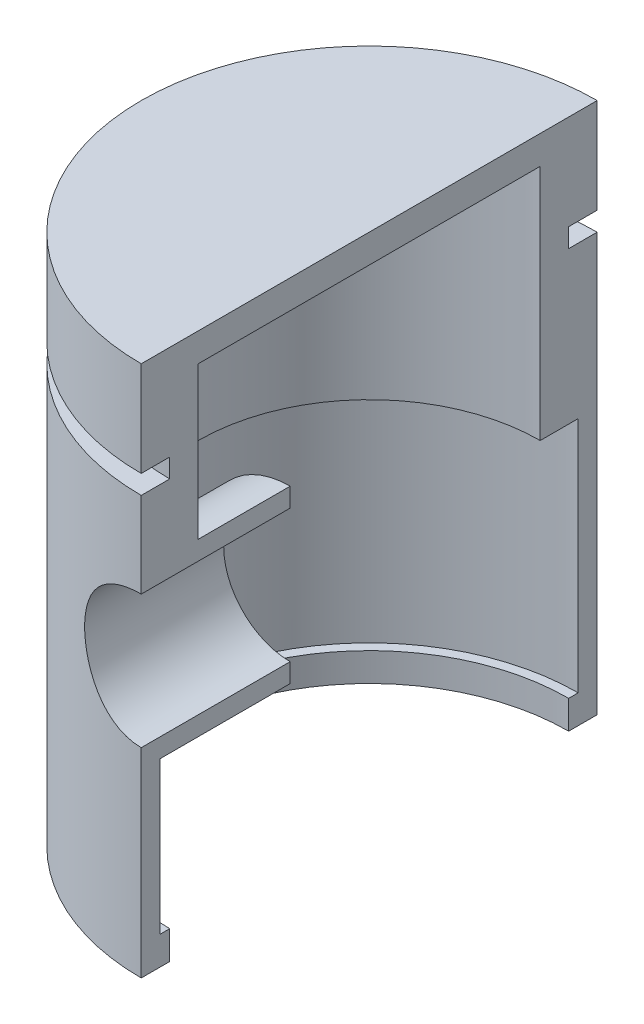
ISO-10303-21;
HEADER;
FILE_DESCRIPTION(('STEP AP214'),'2;1');
FILE_NAME('part.step','',(''),(''),'','','');
FILE_SCHEMA(('AUTOMOTIVE_DESIGN { 1 0 10303 214 1 1 1 1 }'));
ENDSEC;
DATA;
#1=APPLICATION_CONTEXT('core data for automotive mechanical design processes');
#2=APPLICATION_PROTOCOL_DEFINITION('international standard','automotive_design',2000,#1);
#3=PRODUCT_CONTEXT('',#1,'mechanical');
#4=PRODUCT('Part','Part','',(#3));
#5=PRODUCT_RELATED_PRODUCT_CATEGORY('part','',(#4));
#6=PRODUCT_DEFINITION_FORMATION('','',#4);
#7=PRODUCT_DEFINITION_CONTEXT('part definition',#1,'design');
#8=PRODUCT_DEFINITION('design','',#6,#7);
#9=PRODUCT_DEFINITION_SHAPE('','',#8);
#10=(LENGTH_UNIT() NAMED_UNIT(*) SI_UNIT(.MILLI.,.METRE.));
#11=(NAMED_UNIT(*) PLANE_ANGLE_UNIT() SI_UNIT($,.RADIAN.));
#12=(NAMED_UNIT(*) SI_UNIT($,.STERADIAN.) SOLID_ANGLE_UNIT());
#13=UNCERTAINTY_MEASURE_WITH_UNIT(LENGTH_MEASURE(1.E-05),#10,'distance_accuracy_value','');
#14=(GEOMETRIC_REPRESENTATION_CONTEXT(3) GLOBAL_UNCERTAINTY_ASSIGNED_CONTEXT((#13)) GLOBAL_UNIT_ASSIGNED_CONTEXT((#10,
#11,#12)) REPRESENTATION_CONTEXT('',''));
#15=CARTESIAN_POINT('',(0.,0.,0.));
#16=DIRECTION('',(0.,0.,1.));
#17=DIRECTION('',(1.,0.,0.));
#18=AXIS2_PLACEMENT_3D('',#15,#16,#17);
#19=CARTESIAN_POINT('',(0.,88.9,0.));
#20=DIRECTION('',(0.,-1.,0.));
#21=DIRECTION('',(0.,0.,-1.));
#22=AXIS2_PLACEMENT_3D('',#19,#20,#21);
#23=CYLINDRICAL_SURFACE('',#22,38.1);
#24=DIRECTION('',(0.,1.,0.));
#25=VECTOR('',#24,1.);
#26=CARTESIAN_POINT('',(2.66050878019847E-13,0.,38.1));
#27=LINE('',#26,#25);
#28=CARTESIAN_POINT('',(2.66050878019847E-13,55.5625,38.1));
#29=VERTEX_POINT('',#28);
#30=CARTESIAN_POINT('',(-1.13939569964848E-10,69.85,38.1));
#31=VERTEX_POINT('',#30);
#32=EDGE_CURVE('E193',#29,#31,#27,.T.);
#33=ORIENTED_EDGE('',*,*,#32,.T.);
#34=CARTESIAN_POINT('',(-1.13939569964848E-10,69.85,0.));
#35=DIRECTION('',(0.,1.,0.));
#36=DIRECTION('',(0.,0.,1.));
#37=AXIS2_PLACEMENT_3D('',#34,#35,#36);
#38=CIRCLE('',#37,38.1);
#39=CARTESIAN_POINT('',(-2.66050878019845E-13,69.85,-38.1));
#40=VERTEX_POINT('',#39);
#41=EDGE_CURVE('E238',#40,#31,#38,.T.);
#42=ORIENTED_EDGE('',*,*,#41,.F.);
#43=DIRECTION('',(0.,1.,0.));
#44=VECTOR('',#43,1.);
#45=CARTESIAN_POINT('',(0.,0.,-38.1));
#46=LINE('',#45,#44);
#47=CARTESIAN_POINT('',(0.,0.,-38.1));
#48=VERTEX_POINT('',#47);
#49=EDGE_CURVE('E161',#48,#40,#46,.T.);
#50=ORIENTED_EDGE('',*,*,#49,.F.);
#51=CARTESIAN_POINT('',(0.,0.,0.));
#52=DIRECTION('',(0.,-1.,0.));
#53=DIRECTION('',(0.,0.,-1.));
#54=AXIS2_PLACEMENT_3D('',#51,#52,#53);
#55=CIRCLE('',#54,38.1);
#56=CARTESIAN_POINT('',(2.66050878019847E-13,0.,38.1));
#57=VERTEX_POINT('',#56);
#58=EDGE_CURVE('E228',#57,#48,#55,.T.);
#59=ORIENTED_EDGE('',*,*,#58,.F.);
#60=CARTESIAN_POINT('',(2.66050878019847E-13,33.3375,38.1));
#61=VERTEX_POINT('',#60);
#62=EDGE_CURVE('E189',#57,#61,#27,.T.);
#63=ORIENTED_EDGE('',*,*,#62,.T.);
#64=CARTESIAN_POINT('',(2.58462887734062E-13,33.3375,38.1));
#65=CARTESIAN_POINT('',(-0.305678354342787,33.3374597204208,38.100035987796));
#66=CARTESIAN_POINT('',(-0.611343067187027,33.3501109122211,38.0963225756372));
#67=CARTESIAN_POINT('',(-1.22036643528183,33.4004993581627,38.0816587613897));
#68=CARTESIAN_POINT('',(-1.52372551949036,33.4382318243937,38.0707097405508));
#69=CARTESIAN_POINT('',(-2.12528794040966,33.5383714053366,38.0418693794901));
#70=CARTESIAN_POINT('',(-2.42350148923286,33.6007218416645,38.0239939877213));
#71=CARTESIAN_POINT('',(-3.01338059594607,33.7495464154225,37.9817973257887));
#72=CARTESIAN_POINT('',(-3.30504603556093,33.8360209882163,37.9574759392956));
#73=CARTESIAN_POINT('',(-3.87970046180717,34.0323351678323,37.903050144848));
#74=CARTESIAN_POINT('',(-4.16269313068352,34.1421646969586,37.8729482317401));
#75=CARTESIAN_POINT('',(-4.71837293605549,34.3843895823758,37.8077406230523));
#76=CARTESIAN_POINT('',(-4.99105614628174,34.5167934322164,37.7726330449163));
#77=CARTESIAN_POINT('',(-5.52425014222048,34.803141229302,37.6983437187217));
#78=CARTESIAN_POINT('',(-5.78476196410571,34.9570833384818,37.6591623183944));
#79=CARTESIAN_POINT('',(-6.2921527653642,35.285511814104,37.5777178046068));
#80=CARTESIAN_POINT('',(-6.53902542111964,35.4600075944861,37.5354532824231));
#81=CARTESIAN_POINT('',(-7.02337262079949,35.8328336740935,37.4478875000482));
#82=CARTESIAN_POINT('',(-7.26047055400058,36.0316418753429,37.4025372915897));
#83=CARTESIAN_POINT('',(-7.71708594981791,36.4481441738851,37.3110009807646));
#84=CARTESIAN_POINT('',(-7.93661079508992,36.6658302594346,37.2648152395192));
#85=CARTESIAN_POINT('',(-8.3569376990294,37.1189157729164,37.1728115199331));
#86=CARTESIAN_POINT('',(-8.557728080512,37.354326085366,37.1269937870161));
#87=CARTESIAN_POINT('',(-8.93905205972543,37.8411742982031,37.0370317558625));
#88=CARTESIAN_POINT('',(-9.11959317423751,38.0926061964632,36.9928868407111));
#89=CARTESIAN_POINT('',(-9.46289733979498,38.6155229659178,36.9065790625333));
#90=CARTESIAN_POINT('',(-9.62519956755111,38.8873209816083,36.8644784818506));
#91=CARTESIAN_POINT('',(-9.92625651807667,39.4442737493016,36.7845579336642));
#92=CARTESIAN_POINT('',(-10.0650108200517,39.7294287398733,36.7467380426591));
#93=CARTESIAN_POINT('',(-10.317819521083,40.311064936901,36.676556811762));
#94=CARTESIAN_POINT('',(-10.4318794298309,40.6075435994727,36.6441942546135));
#95=CARTESIAN_POINT('',(-10.6343480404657,41.2097531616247,36.5859502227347));
#96=CARTESIAN_POINT('',(-10.7227576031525,41.5154837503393,36.5600685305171));
#97=CARTESIAN_POINT('',(-10.871115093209,42.1256800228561,36.5162249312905));
#98=CARTESIAN_POINT('',(-10.9317574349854,42.4299630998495,36.4980707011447));
#99=CARTESIAN_POINT('',(-11.0274150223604,43.0428850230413,36.4692832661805));
#100=CARTESIAN_POINT('',(-11.0624306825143,43.3515237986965,36.4586499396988));
#101=CARTESIAN_POINT('',(-11.1064992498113,43.9707656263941,36.4452494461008));
#102=CARTESIAN_POINT('',(-11.1155567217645,44.2813683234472,36.4424808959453));
#103=CARTESIAN_POINT('',(-11.1076340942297,44.902206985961,36.4448965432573));
#104=CARTESIAN_POINT('',(-11.0906545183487,45.2124429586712,36.4500805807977));
#105=CARTESIAN_POINT('',(-11.0318413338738,45.819671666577,36.4679225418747));
#106=CARTESIAN_POINT('',(-10.9908717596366,46.1167562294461,36.4803205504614));
#107=CARTESIAN_POINT('',(-10.8851518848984,46.7062801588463,36.5120050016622));
#108=CARTESIAN_POINT('',(-10.8204022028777,46.9987196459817,36.5312912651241));
#109=CARTESIAN_POINT('',(-10.6676657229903,47.5769795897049,36.5761839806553));
#110=CARTESIAN_POINT('',(-10.5796776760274,47.8627996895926,36.6017907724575));
#111=CARTESIAN_POINT('',(-10.3811726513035,48.4259335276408,36.6585856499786));
#112=CARTESIAN_POINT('',(-10.2706552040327,48.7032470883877,36.6897738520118));
#113=CARTESIAN_POINT('',(-10.0263614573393,49.2511305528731,36.7572895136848));
#114=CARTESIAN_POINT('',(-9.89230339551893,49.5215672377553,36.7936781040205));
#115=CARTESIAN_POINT('',(-9.60285952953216,50.0503232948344,36.8702793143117));
#116=CARTESIAN_POINT('',(-9.44746637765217,50.3086384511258,36.9104932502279));
#117=CARTESIAN_POINT('',(-9.11644747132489,50.8114977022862,36.9936412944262));
#118=CARTESIAN_POINT('',(-8.94082159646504,51.0560417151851,37.0365754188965));
#119=CARTESIAN_POINT('',(-8.57046886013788,51.5299120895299,37.1240253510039));
#120=CARTESIAN_POINT('',(-8.37574148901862,51.7592380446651,37.1685412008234));
#121=CARTESIAN_POINT('',(-7.9603410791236,52.2100410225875,37.2597630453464));
#122=CARTESIAN_POINT('',(-7.7389473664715,52.4308510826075,37.3064861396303));
#123=CARTESIAN_POINT('',(-7.27832119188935,52.8530516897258,37.3990802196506));
#124=CARTESIAN_POINT('',(-7.03909409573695,53.0544480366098,37.4449514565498));
#125=CARTESIAN_POINT('',(-6.54415984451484,53.4366246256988,37.5346138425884));
#126=CARTESIAN_POINT('',(-6.28844549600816,53.6173957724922,37.578404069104));
#127=CARTESIAN_POINT('',(-5.76228967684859,53.9569290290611,37.662673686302));
#128=CARTESIAN_POINT('',(-5.49184868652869,54.115691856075,37.7031531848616));
#129=CARTESIAN_POINT('',(-4.93617872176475,54.4109959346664,37.7799326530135));
#130=CARTESIAN_POINT('',(-4.65086357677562,54.5473828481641,37.8162031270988));
#131=CARTESIAN_POINT('',(-4.06910117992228,54.795533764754,37.8832170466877));
#132=CARTESIAN_POINT('',(-3.77265447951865,54.9072989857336,37.913960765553));
#133=CARTESIAN_POINT('',(-3.17111218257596,55.1051317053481,37.9690024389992));
#134=CARTESIAN_POINT('',(-2.86602721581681,55.1912294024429,37.9933079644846));
#135=CARTESIAN_POINT('',(-2.24927923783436,55.3370914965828,38.0348028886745));
#136=CARTESIAN_POINT('',(-1.93761928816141,55.3968678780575,38.0519955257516));
#137=CARTESIAN_POINT('',(-1.35507672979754,55.4829149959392,38.0768440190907));
#138=CARTESIAN_POINT('',(-1.08475980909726,55.5127626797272,38.0855143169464));
#139=CARTESIAN_POINT('',(-0.542968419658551,55.5525508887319,38.0970985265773));
#140=CARTESIAN_POINT('',(-0.271496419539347,55.5625224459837,38.1000214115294));
#141=CARTESIAN_POINT('',(2.57777615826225E-13,55.5625,38.1));
#142=B_SPLINE_CURVE_WITH_KNOTS('',3,(#64,#65,#66,#67,#68,#69,#70,#71,#72,#73,#74,#75,#76,#77,
#78,#79,#80,#81,#82,#83,#84,#85,#86,#87,#88,#89,#90,#91,#92,#93,#94,#95,#96,#97,#98,#99,#100,
#101,#102,#103,#104,#105,#106,#107,#108,#109,#110,#111,#112,#113,#114,#115,#116,#117,#118,#119,
#120,#121,#122,#123,#124,#125,#126,#127,#128,#129,#130,#131,#132,#133,#134,#135,#136,#137,#138,
#139,#140,#141),.UNSPECIFIED.,.F.,.F.,(4,2,2,2,2,2,2,2,2,2,2,2,2,2,2,2,2,2,2,2,2,2,2,2,2,2,2,2,
2,2,2,2,2,2,2,2,2,2,4),(0.,0.916729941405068,1.83328493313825,2.74774191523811,3.66221540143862,
4.5762950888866,5.49071945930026,6.40506584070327,7.31983264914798,8.25693335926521,
9.19363829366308,10.1309232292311,11.0678590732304,12.0247605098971,12.9816790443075,
13.9383838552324,14.8950565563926,15.8262861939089,16.7575007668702,17.6885515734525,
18.6195836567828,19.5189832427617,20.4183594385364,21.3177839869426,22.2172272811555,
23.1282784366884,24.0396441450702,24.9510152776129,25.862410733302,26.8097755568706,
27.7568564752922,28.704353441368,29.6518195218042,30.6055684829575,31.5592702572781,
32.5118455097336,33.4639865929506,34.2795060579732,35.0937512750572),.UNSPECIFIED.);
#143=EDGE_CURVE('E239',#61,#29,#142,.T.);
#144=ORIENTED_EDGE('',*,*,#143,.T.);
#145=EDGE_LOOP('',(#33,#42,#50,#59,#63,#144));
#146=FACE_BOUND('',#145,.T.);
#147=ADVANCED_FACE('F32',(#146),#23,.T.);
#148=CARTESIAN_POINT('',(-2.66050878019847E-13,73.025,-38.1));
#149=VERTEX_POINT('',#148);
#150=CARTESIAN_POINT('',(0.,88.9,-38.1));
#151=VERTEX_POINT('',#150);
#152=EDGE_CURVE('E167',#149,#151,#46,.T.);
#153=ORIENTED_EDGE('',*,*,#152,.F.);
#154=CARTESIAN_POINT('',(-1.13939569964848E-10,73.025,0.));
#155=DIRECTION('',(0.,1.,0.));
#156=DIRECTION('',(0.,0.,1.));
#157=AXIS2_PLACEMENT_3D('',#154,#155,#156);
#158=CIRCLE('',#157,38.1);
#159=CARTESIAN_POINT('',(2.66050878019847E-13,73.025,38.1));
#160=VERTEX_POINT('',#159);
#161=EDGE_CURVE('E246',#149,#160,#158,.T.);
#162=ORIENTED_EDGE('',*,*,#161,.T.);
#163=CARTESIAN_POINT('',(2.66050878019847E-13,88.9,38.1));
#164=VERTEX_POINT('',#163);
#165=EDGE_CURVE('E188',#160,#164,#27,.T.);
#166=ORIENTED_EDGE('',*,*,#165,.T.);
#167=CARTESIAN_POINT('',(0.,88.9,0.));
#168=DIRECTION('',(0.,-1.,0.));
#169=DIRECTION('',(0.,0.,-1.));
#170=AXIS2_PLACEMENT_3D('',#167,#168,#169);
#171=CIRCLE('',#170,38.1);
#172=EDGE_CURVE('E212',#164,#151,#171,.T.);
#173=ORIENTED_EDGE('',*,*,#172,.T.);
#174=EDGE_LOOP('',(#153,#162,#166,#173));
#175=FACE_BOUND('',#174,.T.);
#176=ADVANCED_FACE('F245',(#175),#23,.T.);
#177=CARTESIAN_POINT('',(2.66050878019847E-13,84.1375,38.1));
#178=DIRECTION('',(1.,0.,0.));
#179=DIRECTION('',(0.,0.,-1.));
#180=AXIS2_PLACEMENT_3D('',#177,#178,#179);
#181=PLANE('',#180);
#182=ORIENTED_EDGE('',*,*,#49,.T.);
#183=DIRECTION('',(0.,0.,1.));
#184=VECTOR('',#183,1.);
#185=CARTESIAN_POINT('',(2.66050878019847E-13,69.85,38.1));
#186=LINE('',#185,#184);
#187=CARTESIAN_POINT('',(-2.32794518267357E-13,69.85,-33.3375));
#188=VERTEX_POINT('',#187);
#189=EDGE_CURVE('E11',#40,#188,#186,.T.);
#190=ORIENTED_EDGE('',*,*,#189,.T.);
#191=DIRECTION('',(0.,1.,0.));
#192=VECTOR('',#191,1.);
#193=CARTESIAN_POINT('',(-2.32794518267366E-13,73.025,-33.3375));
#194=LINE('',#193,#192);
#195=CARTESIAN_POINT('',(-2.32794518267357E-13,73.025,-33.3375));
#196=VERTEX_POINT('',#195);
#197=EDGE_CURVE('E36',#188,#196,#194,.T.);
#198=ORIENTED_EDGE('',*,*,#197,.T.);
#199=DIRECTION('',(0.,0.,-1.));
#200=VECTOR('',#199,1.);
#201=CARTESIAN_POINT('',(2.66050878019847E-13,73.025,38.1));
#202=LINE('',#201,#200);
#203=EDGE_CURVE('E41',#196,#149,#202,.T.);
#204=ORIENTED_EDGE('',*,*,#203,.T.);
#205=ORIENTED_EDGE('',*,*,#152,.T.);
#206=DIRECTION('',(0.,0.,-1.));
#207=VECTOR('',#206,1.);
#208=CARTESIAN_POINT('',(2.66050878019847E-13,88.9,38.1));
#209=LINE('',#208,#207);
#210=EDGE_CURVE('E192',#164,#151,#209,.T.);
#211=ORIENTED_EDGE('',*,*,#210,.F.);
#212=ORIENTED_EDGE('',*,*,#165,.F.);
#213=CARTESIAN_POINT('',(-1.13939569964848E-10,73.025,33.3375));
#214=VERTEX_POINT('',#213);
#215=EDGE_CURVE('E232',#160,#214,#202,.T.);
#216=ORIENTED_EDGE('',*,*,#215,.T.);
#217=DIRECTION('',(0.,1.,0.));
#218=VECTOR('',#217,1.);
#219=CARTESIAN_POINT('',(2.32794518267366E-13,73.025,33.3375));
#220=LINE('',#219,#218);
#221=CARTESIAN_POINT('',(2.32794518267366E-13,69.85,33.3375));
#222=VERTEX_POINT('',#221);
#223=EDGE_CURVE('E230',#214,#222,#220,.F.);
#224=ORIENTED_EDGE('',*,*,#223,.T.);
#225=EDGE_CURVE('E42',#222,#31,#186,.T.);
#226=ORIENTED_EDGE('',*,*,#225,.T.);
#227=ORIENTED_EDGE('',*,*,#32,.F.);
#228=DIRECTION('',(0.,0.,-1.));
#229=VECTOR('',#228,1.);
#230=CARTESIAN_POINT('',(2.66050878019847E-13,55.5625,38.1));
#231=LINE('',#230,#229);
#232=CARTESIAN_POINT('',(2.66051032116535E-13,55.5625,13.208));
#233=VERTEX_POINT('',#232);
#234=EDGE_CURVE('E258',#29,#233,#231,.T.);
#235=ORIENTED_EDGE('',*,*,#234,.T.);
#236=DIRECTION('',(0.,1.,0.));
#237=VECTOR('',#236,1.);
#238=CARTESIAN_POINT('',(2.66051032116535E-13,30.1625,13.208));
#239=LINE('',#238,#237);
#240=CARTESIAN_POINT('',(2.66051032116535E-13,58.7375,13.208));
#241=VERTEX_POINT('',#240);
#242=EDGE_CURVE('E310',#233,#241,#239,.T.);
#243=ORIENTED_EDGE('',*,*,#242,.T.);
#244=DIRECTION('',(0.,0.,-1.));
#245=VECTOR('',#244,1.);
#246=CARTESIAN_POINT('',(2.66051032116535E-13,58.7375,500000.));
#247=LINE('',#246,#245);
#248=CARTESIAN_POINT('',(1.99538158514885E-13,58.7375,28.575));
#249=VERTEX_POINT('',#248);
#250=EDGE_CURVE('E174',#249,#241,#247,.T.);
#251=ORIENTED_EDGE('',*,*,#250,.F.);
#252=DIRECTION('',(0.,-1.,0.));
#253=VECTOR('',#252,1.);
#254=CARTESIAN_POINT('',(1.99538158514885E-13,84.1375,28.575));
#255=LINE('',#254,#253);
#256=CARTESIAN_POINT('',(1.99538158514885E-13,84.1375,28.575));
#257=VERTEX_POINT('',#256);
#258=EDGE_CURVE('E199',#257,#249,#255,.T.);
#259=ORIENTED_EDGE('',*,*,#258,.F.);
#260=DIRECTION('',(0.,0.,1.));
#261=VECTOR('',#260,1.);
#262=CARTESIAN_POINT('',(0.,84.1375,0.));
#263=LINE('',#262,#261);
#264=CARTESIAN_POINT('',(0.,84.1375,-28.575));
#265=VERTEX_POINT('',#264);
#266=EDGE_CURVE('E196',#265,#257,#263,.T.);
#267=ORIENTED_EDGE('',*,*,#266,.F.);
#268=DIRECTION('',(0.,-1.,0.));
#269=VECTOR('',#268,1.);
#270=CARTESIAN_POINT('',(0.,84.1375,-28.575));
#271=LINE('',#270,#269);
#272=CARTESIAN_POINT('',(0.,44.45,-28.575));
#273=VERTEX_POINT('',#272);
#274=EDGE_CURVE('E166',#265,#273,#271,.T.);
#275=ORIENTED_EDGE('',*,*,#274,.T.);
#276=DIRECTION('',(0.,0.,-1.));
#277=VECTOR('',#276,1.);
#278=CARTESIAN_POINT('',(0.,44.45,-28.575));
#279=LINE('',#278,#277);
#280=CARTESIAN_POINT('',(0.,44.45,-34.925));
#281=VERTEX_POINT('',#280);
#282=EDGE_CURVE('E170',#273,#281,#279,.T.);
#283=ORIENTED_EDGE('',*,*,#282,.T.);
#284=DIRECTION('',(0.,-1.,0.));
#285=VECTOR('',#284,1.);
#286=CARTESIAN_POINT('',(0.,44.45,-34.925));
#287=LINE('',#286,#285);
#288=CARTESIAN_POINT('',(0.,4.7625,-34.925));
#289=VERTEX_POINT('',#288);
#290=EDGE_CURVE('E179',#281,#289,#287,.T.);
#291=ORIENTED_EDGE('',*,*,#290,.T.);
#292=DIRECTION('',(0.,0.,1.));
#293=VECTOR('',#292,1.);
#294=CARTESIAN_POINT('',(0.,4.7625,-34.925));
#295=LINE('',#294,#293);
#296=CARTESIAN_POINT('',(0.,4.7625,-33.3375));
#297=VERTEX_POINT('',#296);
#298=EDGE_CURVE('E182',#289,#297,#295,.T.);
#299=ORIENTED_EDGE('',*,*,#298,.T.);
#300=DIRECTION('',(0.,-1.,0.));
#301=VECTOR('',#300,1.);
#302=CARTESIAN_POINT('',(0.,4.7625,-33.3375));
#303=LINE('',#302,#301);
#304=CARTESIAN_POINT('',(0.,0.,-33.3375));
#305=VERTEX_POINT('',#304);
#306=EDGE_CURVE('E185',#297,#305,#303,.T.);
#307=ORIENTED_EDGE('',*,*,#306,.T.);
#308=DIRECTION('',(0.,0.,-1.));
#309=VECTOR('',#308,1.);
#310=CARTESIAN_POINT('',(0.,0.,-33.3375));
#311=LINE('',#310,#309);
#312=EDGE_CURVE('E164',#305,#48,#311,.T.);
#313=ORIENTED_EDGE('',*,*,#312,.T.);
#314=EDGE_LOOP('',(#182,#190,#198,#204,#205,#211,#212,#216,#224,#226,#227,#235,#243,#251,#259,
#267,#275,#283,#291,#299,#307,#313));
#315=FACE_BOUND('',#314,.T.);
#316=ADVANCED_FACE('F158',(#315),#181,.T.);
#317=CARTESIAN_POINT('',(2.66051032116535E-13,30.1625,13.208));
#318=VERTEX_POINT('',#317);
#319=CARTESIAN_POINT('',(2.66051032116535E-13,33.3375,13.208));
#320=VERTEX_POINT('',#319);
#321=EDGE_CURVE('E308',#318,#320,#239,.T.);
#322=ORIENTED_EDGE('',*,*,#321,.T.);
#323=DIRECTION('',(0.,0.,-1.));
#324=VECTOR('',#323,1.);
#325=CARTESIAN_POINT('',(2.66050878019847E-13,33.3375,38.1));
#326=LINE('',#325,#324);
#327=EDGE_CURVE('E57',#320,#61,#326,.F.);
#328=ORIENTED_EDGE('',*,*,#327,.T.);
#329=ORIENTED_EDGE('',*,*,#62,.F.);
#330=DIRECTION('',(0.,0.,1.));
#331=VECTOR('',#330,1.);
#332=CARTESIAN_POINT('',(2.32794518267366E-13,0.,33.3375));
#333=LINE('',#332,#331);
#334=CARTESIAN_POINT('',(2.32794518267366E-13,0.,33.3375));
#335=VERTEX_POINT('',#334);
#336=EDGE_CURVE('E209',#335,#57,#333,.T.);
#337=ORIENTED_EDGE('',*,*,#336,.F.);
#338=DIRECTION('',(0.,-1.,0.));
#339=VECTOR('',#338,1.);
#340=CARTESIAN_POINT('',(2.32794518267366E-13,4.7625,33.3375));
#341=LINE('',#340,#339);
#342=CARTESIAN_POINT('',(2.32794518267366E-13,4.7625,33.3375));
#343=VERTEX_POINT('',#342);
#344=EDGE_CURVE('E206',#343,#335,#341,.T.);
#345=ORIENTED_EDGE('',*,*,#344,.F.);
#346=DIRECTION('',(0.,0.,-1.));
#347=VECTOR('',#346,1.);
#348=CARTESIAN_POINT('',(2.43879971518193E-13,4.7625,34.925));
#349=LINE('',#348,#347);
#350=CARTESIAN_POINT('',(2.43879971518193E-13,4.7625,34.925));
#351=VERTEX_POINT('',#350);
#352=EDGE_CURVE('E203',#351,#343,#349,.T.);
#353=ORIENTED_EDGE('',*,*,#352,.F.);
#354=DIRECTION('',(0.,-1.,0.));
#355=VECTOR('',#354,1.);
#356=CARTESIAN_POINT('',(2.43879971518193E-13,44.45,34.925));
#357=LINE('',#356,#355);
#358=CARTESIAN_POINT('',(2.66051032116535E-13,30.1625,34.924999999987));
#359=VERTEX_POINT('',#358);
#360=EDGE_CURVE('E201',#359,#351,#357,.T.);
#361=ORIENTED_EDGE('',*,*,#360,.F.);
#362=DIRECTION('',(0.,0.,-1.));
#363=VECTOR('',#362,1.);
#364=CARTESIAN_POINT('',(2.66051032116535E-13,30.1625,500000.));
#365=LINE('',#364,#363);
#366=EDGE_CURVE('E305',#359,#318,#365,.T.);
#367=ORIENTED_EDGE('',*,*,#366,.T.);
#368=EDGE_LOOP('',(#322,#328,#329,#337,#345,#353,#361,#367));
#369=FACE_BOUND('',#368,.T.);
#370=ADVANCED_FACE('F296',(#369),#181,.T.);
#371=CARTESIAN_POINT('',(0.,44.45,13.208));
#372=DIRECTION('',(0.,0.,1.));
#373=DIRECTION('',(1.,0.,0.));
#374=AXIS2_PLACEMENT_3D('',#371,#372,#373);
#375=PLANE('',#374);
#376=CARTESIAN_POINT('',(0.,44.45,13.208));
#377=DIRECTION('',(0.,0.,1.));
#378=DIRECTION('',(1.,0.,0.));
#379=AXIS2_PLACEMENT_3D('',#376,#377,#378);
#380=CIRCLE('',#379,11.1125);
#381=EDGE_CURVE('E253',#233,#320,#380,.T.);
#382=ORIENTED_EDGE('',*,*,#381,.T.);
#383=ORIENTED_EDGE('',*,*,#321,.F.);
#384=CARTESIAN_POINT('',(0.,44.45,13.208));
#385=DIRECTION('',(0.,0.,1.));
#386=DIRECTION('',(1.,0.,0.));
#387=AXIS2_PLACEMENT_3D('',#384,#385,#386);
#388=CIRCLE('',#387,14.2875);
#389=EDGE_CURVE('E172',#241,#318,#388,.T.);
#390=ORIENTED_EDGE('',*,*,#389,.F.);
#391=ORIENTED_EDGE('',*,*,#242,.F.);
#392=EDGE_LOOP('',(#382,#383,#390,#391));
#393=FACE_BOUND('',#392,.T.);
#394=ADVANCED_FACE('F295',(#393),#375,.F.);
#395=CARTESIAN_POINT('',(0.,88.9,0.));
#396=DIRECTION('',(0.,-1.,0.));
#397=DIRECTION('',(0.,0.,-1.));
#398=AXIS2_PLACEMENT_3D('',#395,#396,#397);
#399=CYLINDRICAL_SURFACE('',#398,34.925);
#400=CARTESIAN_POINT('',(0.,44.45,0.));
#401=DIRECTION('',(0.,-1.,0.));
#402=DIRECTION('',(0.,0.,-1.));
#403=AXIS2_PLACEMENT_3D('',#400,#401,#402);
#404=CIRCLE('',#403,34.925);
#405=CARTESIAN_POINT('',(-14.2875,44.45,31.868840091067));
#406=VERTEX_POINT('',#405);
#407=EDGE_CURVE('E220',#406,#281,#404,.T.);
#408=ORIENTED_EDGE('',*,*,#407,.F.);
#409=CARTESIAN_POINT('',(2.69111403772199E-13,30.1625,34.925));
#410=CARTESIAN_POINT('',(-0.192474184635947,30.1624993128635,34.9250019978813));
#411=CARTESIAN_POINT('',(-0.384923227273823,30.1663901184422,34.9234083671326));
#412=CARTESIAN_POINT('',(-0.76944780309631,30.181936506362,34.9170521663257));
#413=CARTESIAN_POINT('',(-0.961523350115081,30.1935917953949,34.9122897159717));
#414=CARTESIAN_POINT('',(-1.53652557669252,30.2401612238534,34.8932890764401));
#415=CARTESIAN_POINT('',(-1.91843046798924,30.2866789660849,34.8743375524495));
#416=CARTESIAN_POINT('',(-2.67505364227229,30.4099430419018,34.8244601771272));
#417=CARTESIAN_POINT('',(-3.04979284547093,30.4865799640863,34.7935776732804));
#418=CARTESIAN_POINT('',(-3.79092495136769,30.6693178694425,34.7206444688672));
#419=CARTESIAN_POINT('',(-4.15731750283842,30.7754200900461,34.6785932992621));
#420=CARTESIAN_POINT('',(-4.87898547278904,31.0159861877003,34.584439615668));
#421=CARTESIAN_POINT('',(-5.23426967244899,31.1504269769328,34.5323452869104));
#422=CARTESIAN_POINT('',(-5.93185702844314,31.4465648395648,34.4193777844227));
#423=CARTESIAN_POINT('',(-6.27415930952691,31.6082637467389,34.3585040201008));
#424=CARTESIAN_POINT('',(-6.94401257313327,31.9577559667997,34.2294135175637));
#425=CARTESIAN_POINT('',(-7.27155348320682,32.145566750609,34.1611918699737));
#426=CARTESIAN_POINT('',(-7.90988396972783,32.5458690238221,34.0190578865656));
#427=CARTESIAN_POINT('',(-8.22067305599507,32.7583612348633,33.9451453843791));
#428=CARTESIAN_POINT('',(-8.83714181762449,33.2165030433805,33.7900274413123));
#429=CARTESIAN_POINT('',(-9.14200033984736,33.4631977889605,33.7086443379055));
#430=CARTESIAN_POINT('',(-9.73017641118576,33.9805311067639,33.5435931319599));
#431=CARTESIAN_POINT('',(-10.0134870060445,34.2511773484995,33.4599243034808));
#432=CARTESIAN_POINT('',(-10.5569976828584,34.8148673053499,33.2924364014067));
#433=CARTESIAN_POINT('',(-10.8171914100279,35.1079171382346,33.2086172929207));
#434=CARTESIAN_POINT('',(-11.3129043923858,35.7147632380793,33.0430344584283));
#435=CARTESIAN_POINT('',(-11.5484222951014,36.0285606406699,32.9612708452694));
#436=CARTESIAN_POINT('',(-12.0039615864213,36.6907042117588,32.7981987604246));
#437=CARTESIAN_POINT('',(-12.2227018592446,37.0399851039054,32.7170993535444));
#438=CARTESIAN_POINT('',(-12.6297067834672,37.7572346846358,32.5621491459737));
#439=CARTESIAN_POINT('',(-12.8179834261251,38.1251959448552,32.488295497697));
#440=CARTESIAN_POINT('',(-13.1623429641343,38.8771880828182,32.3503129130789));
#441=CARTESIAN_POINT('',(-13.3184584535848,39.2612022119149,32.2861741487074));
#442=CARTESIAN_POINT('',(-13.5971435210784,40.042913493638,32.1698020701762));
#443=CARTESIAN_POINT('',(-13.7197221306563,40.4406069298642,32.1175655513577));
#444=CARTESIAN_POINT('',(-13.9012031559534,41.1362753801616,32.0393358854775));
#445=CARTESIAN_POINT('',(-13.9683514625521,41.4317613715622,32.0100728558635));
#446=CARTESIAN_POINT('',(-14.083809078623,42.0270150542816,31.959441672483));
#447=CARTESIAN_POINT('',(-14.1321225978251,42.3267817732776,31.9380717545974));
#448=CARTESIAN_POINT('',(-14.2096321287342,42.9296534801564,31.9036656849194));
#449=CARTESIAN_POINT('',(-14.2388029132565,43.2327623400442,31.8906405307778));
#450=CARTESIAN_POINT('',(-14.2777524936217,43.8405759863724,31.8732094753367));
#451=CARTESIAN_POINT('',(-14.2875244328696,44.1452812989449,31.8688066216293));
#452=CARTESIAN_POINT('',(-14.2875,44.45,31.868840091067));
#453=B_SPLINE_CURVE_WITH_KNOTS('',3,(#409,#410,#411,#412,#413,#414,#415,#416,#417,#418,#419,
#420,#421,#422,#423,#424,#425,#426,#427,#428,#429,#430,#431,#432,#433,#434,#435,#436,#437,#438,
#439,#440,#441,#442,#443,#444,#445,#446,#447,#448,#449,#450,#451,#452),.UNSPECIFIED.,.F.,.F.,(4,
2,2,2,2,2,2,2,2,2,2,2,2,2,2,2,2,2,2,2,2,4),(0.,0.577326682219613,1.15463155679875,
2.3086355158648,3.45848560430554,4.60838398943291,5.75734913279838,6.90639160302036,
8.05620660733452,9.20605523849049,10.4063074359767,11.6069453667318,12.8079123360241,
14.0089450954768,15.2674586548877,16.5254756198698,17.7822112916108,19.0386081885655,
19.9512350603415,20.8636578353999,21.7772806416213,22.6912263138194),.UNSPECIFIED.);
#454=EDGE_CURVE('E298',#359,#406,#453,.T.);
#455=ORIENTED_EDGE('',*,*,#454,.F.);
#456=ORIENTED_EDGE('',*,*,#360,.T.);
#457=CARTESIAN_POINT('',(0.,4.7625,0.));
#458=DIRECTION('',(0.,-1.,0.));
#459=DIRECTION('',(0.,0.,-1.));
#460=AXIS2_PLACEMENT_3D('',#457,#458,#459);
#461=CIRCLE('',#460,34.925);
#462=EDGE_CURVE('E222',#351,#289,#461,.T.);
#463=ORIENTED_EDGE('',*,*,#462,.T.);
#464=ORIENTED_EDGE('',*,*,#290,.F.);
#465=EDGE_LOOP('',(#408,#455,#456,#463,#464));
#466=FACE_BOUND('',#465,.T.);
#467=ADVANCED_FACE('F324',(#466),#399,.F.);
#468=CARTESIAN_POINT('',(1.99538158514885E-13,44.45,28.575));
#469=DIRECTION('',(0.,-1.,0.));
#470=DIRECTION('',(0.,0.,-1.));
#471=AXIS2_PLACEMENT_3D('',#468,#469,#470);
#472=PLANE('',#471);
#473=CARTESIAN_POINT('',(0.,44.45,0.));
#474=DIRECTION('',(0.,-1.,0.));
#475=DIRECTION('',(0.,0.,-1.));
#476=AXIS2_PLACEMENT_3D('',#473,#474,#475);
#477=CIRCLE('',#476,28.575);
#478=CARTESIAN_POINT('',(-14.2875,44.45,24.7466759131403));
#479=VERTEX_POINT('',#478);
#480=EDGE_CURVE('E218',#479,#273,#477,.T.);
#481=ORIENTED_EDGE('',*,*,#480,.F.);
#482=DIRECTION('',(0.,0.,-1.));
#483=VECTOR('',#482,1.);
#484=CARTESIAN_POINT('',(-14.2875,44.45,500000.));
#485=LINE('',#484,#483);
#486=EDGE_CURVE('E290',#406,#479,#485,.T.);
#487=ORIENTED_EDGE('',*,*,#486,.F.);
#488=ORIENTED_EDGE('',*,*,#407,.T.);
#489=ORIENTED_EDGE('',*,*,#282,.F.);
#490=EDGE_LOOP('',(#481,#487,#488,#489));
#491=FACE_BOUND('',#490,.T.);
#492=ADVANCED_FACE('F330',(#491),#472,.T.);
#493=CARTESIAN_POINT('',(0.,88.9,0.));
#494=DIRECTION('',(0.,-1.,0.));
#495=DIRECTION('',(0.,0.,-1.));
#496=AXIS2_PLACEMENT_3D('',#493,#494,#495);
#497=CYLINDRICAL_SURFACE('',#496,28.575);
#498=ORIENTED_EDGE('',*,*,#258,.T.);
#499=CARTESIAN_POINT('',(-14.2875,44.45,24.7466759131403));
#500=CARTESIAN_POINT('',(-14.2875013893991,44.6370990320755,24.7466716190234));
#501=CARTESIAN_POINT('',(-14.2838240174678,44.8241716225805,24.748798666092));
#502=CARTESIAN_POINT('',(-14.2691359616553,45.197925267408,24.7572714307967));
#503=CARTESIAN_POINT('',(-14.2581255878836,45.3846063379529,24.7636169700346));
#504=CARTESIAN_POINT('',(-14.2141557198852,45.9432615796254,24.7889012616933));
#505=CARTESIAN_POINT('',(-14.1702573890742,46.3141667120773,24.8140878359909));
#506=CARTESIAN_POINT('',(-14.0542225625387,47.0478239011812,24.8799885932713));
#507=CARTESIAN_POINT('',(-13.9822517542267,47.4106108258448,24.9206116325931));
#508=CARTESIAN_POINT('',(-13.8109493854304,48.1278073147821,25.0159528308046));
#509=CARTESIAN_POINT('',(-13.7116146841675,48.482215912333,25.0706726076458));
#510=CARTESIAN_POINT('',(-13.4869252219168,49.1796362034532,25.1922553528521));
#511=CARTESIAN_POINT('',(-13.3616274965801,49.5226709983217,25.2590916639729));
#512=CARTESIAN_POINT('',(-13.0860595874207,50.1963156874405,25.4029488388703));
#513=CARTESIAN_POINT('',(-12.9357897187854,50.526925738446,25.4799695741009));
#514=CARTESIAN_POINT('',(-12.6112461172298,51.1746204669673,25.6421534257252));
#515=CARTESIAN_POINT('',(-12.4369407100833,51.4916865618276,25.7273272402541));
#516=CARTESIAN_POINT('',(-12.0655667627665,52.1106177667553,25.9035707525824));
#517=CARTESIAN_POINT('',(-11.8684898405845,52.4124772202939,25.9946426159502));
#518=CARTESIAN_POINT('',(-11.4357385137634,53.0236779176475,26.1880727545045));
#519=CARTESIAN_POINT('',(-11.1982268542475,53.3316200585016,26.2907456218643));
#520=CARTESIAN_POINT('',(-10.6992160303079,53.9268281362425,26.4977426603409));
#521=CARTESIAN_POINT('',(-10.4377156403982,54.2140930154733,26.602066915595));
#522=CARTESIAN_POINT('',(-9.89188651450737,54.7666913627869,26.8098210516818));
#523=CARTESIAN_POINT('',(-9.60754728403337,55.0320146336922,26.9132504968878));
#524=CARTESIAN_POINT('',(-9.0175680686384,55.5390652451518,27.1166262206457));
#525=CARTESIAN_POINT('',(-8.71193527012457,55.7808004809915,27.2165736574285));
#526=CARTESIAN_POINT('',(-8.05910733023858,56.2549610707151,27.4172540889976));
#527=CARTESIAN_POINT('',(-7.71049923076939,56.4856214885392,27.5175740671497));
#528=CARTESIAN_POINT('',(-6.9924224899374,56.9165155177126,27.708747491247));
#529=CARTESIAN_POINT('',(-6.62295182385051,57.1167461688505,27.7996000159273));
#530=CARTESIAN_POINT('',(-5.86603038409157,57.4845368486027,27.9690993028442));
#531=CARTESIAN_POINT('',(-5.47860463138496,57.652140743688,28.0477624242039));
#532=CARTESIAN_POINT('',(-4.68813333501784,57.9530659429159,28.1906580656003));
#533=CARTESIAN_POINT('',(-4.2850918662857,58.0863961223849,28.2548943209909));
#534=CARTESIAN_POINT('',(-3.56319839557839,58.2898659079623,28.3537292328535));
#535=CARTESIAN_POINT('',(-3.24690096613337,58.3674924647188,28.391744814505));
#536=CARTESIAN_POINT('',(-2.60875705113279,58.5010951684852,28.4574747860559));
#537=CARTESIAN_POINT('',(-2.28691181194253,58.5570761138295,28.4851914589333));
#538=CARTESIAN_POINT('',(-1.63860416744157,58.6470039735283,28.5298313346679));
#539=CARTESIAN_POINT('',(-1.31213236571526,58.6808964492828,28.5467278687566));
#540=CARTESIAN_POINT('',(-0.657113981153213,58.7261674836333,28.5693344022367));
#541=CARTESIAN_POINT('',(-0.328566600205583,58.7375367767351,28.575039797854));
#542=CARTESIAN_POINT('',(1.94872661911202E-13,58.7375,28.575));
#543=B_SPLINE_CURVE_WITH_KNOTS('',3,(#499,#500,#501,#502,#503,#504,#505,#506,#507,#508,#509,
#510,#511,#512,#513,#514,#515,#516,#517,#518,#519,#520,#521,#522,#523,#524,#525,#526,#527,#528,
#529,#530,#531,#532,#533,#534,#535,#536,#537,#538,#539,#540,#541,#542),.UNSPECIFIED.,.F.,.F.,(4,
2,2,2,2,2,2,2,2,2,2,2,2,2,2,2,2,2,2,2,2,4),(0.,0.561196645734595,1.12236956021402,
2.24376213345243,3.35863388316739,4.47363364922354,5.58620946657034,6.69877124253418,
7.81281342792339,8.92726699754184,10.132651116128,11.3380968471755,12.544099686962,
13.7496974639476,15.0376775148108,16.3257827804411,17.6121440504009,18.8981718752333,
19.8809946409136,20.8635994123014,21.8486168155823,22.8340393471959),.UNSPECIFIED.);
#544=EDGE_CURVE('E282',#479,#249,#543,.T.);
#545=ORIENTED_EDGE('',*,*,#544,.F.);
#546=ORIENTED_EDGE('',*,*,#480,.T.);
#547=ORIENTED_EDGE('',*,*,#274,.F.);
#548=CARTESIAN_POINT('',(0.,84.1375,0.));
#549=DIRECTION('',(0.,-1.,0.));
#550=DIRECTION('',(0.,0.,-1.));
#551=AXIS2_PLACEMENT_3D('',#548,#549,#550);
#552=CIRCLE('',#551,28.575);
#553=EDGE_CURVE('E215',#257,#265,#552,.T.);
#554=ORIENTED_EDGE('',*,*,#553,.F.);
#555=EDGE_LOOP('',(#498,#545,#546,#547,#554));
#556=FACE_BOUND('',#555,.T.);
#557=ADVANCED_FACE('F334',(#556),#497,.F.);
#558=CARTESIAN_POINT('',(2.32794518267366E-13,0.,33.3375));
#559=DIRECTION('',(0.,-1.,0.));
#560=DIRECTION('',(0.,0.,-1.));
#561=AXIS2_PLACEMENT_3D('',#558,#559,#560);
#562=PLANE('',#561);
#563=CARTESIAN_POINT('',(0.,0.,0.));
#564=DIRECTION('',(0.,-1.,0.));
#565=DIRECTION('',(0.,0.,-1.));
#566=AXIS2_PLACEMENT_3D('',#563,#564,#565);
#567=CIRCLE('',#566,33.3375);
#568=EDGE_CURVE('E226',#335,#305,#567,.T.);
#569=ORIENTED_EDGE('',*,*,#568,.F.);
#570=ORIENTED_EDGE('',*,*,#336,.T.);
#571=ORIENTED_EDGE('',*,*,#58,.T.);
#572=ORIENTED_EDGE('',*,*,#312,.F.);
#573=EDGE_LOOP('',(#569,#570,#571,#572));
#574=FACE_BOUND('',#573,.T.);
#575=ADVANCED_FACE('F34',(#574),#562,.T.);
#576=CARTESIAN_POINT('',(0.,88.9,0.));
#577=DIRECTION('',(0.,-1.,0.));
#578=DIRECTION('',(0.,0.,-1.));
#579=AXIS2_PLACEMENT_3D('',#576,#577,#578);
#580=CYLINDRICAL_SURFACE('',#579,33.3375);
#581=CARTESIAN_POINT('',(0.,4.7625,0.));
#582=DIRECTION('',(0.,-1.,0.));
#583=DIRECTION('',(0.,0.,-1.));
#584=AXIS2_PLACEMENT_3D('',#581,#582,#583);
#585=CIRCLE('',#584,33.3375);
#586=EDGE_CURVE('E224',#343,#297,#585,.T.);
#587=ORIENTED_EDGE('',*,*,#586,.F.);
#588=ORIENTED_EDGE('',*,*,#344,.T.);
#589=ORIENTED_EDGE('',*,*,#568,.T.);
#590=ORIENTED_EDGE('',*,*,#306,.F.);
#591=EDGE_LOOP('',(#587,#588,#589,#590));
#592=FACE_BOUND('',#591,.T.);
#593=ADVANCED_FACE('F344',(#592),#580,.F.);
#594=CARTESIAN_POINT('',(2.43879971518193E-13,4.7625,34.925));
#595=DIRECTION('',(0.,1.,0.));
#596=DIRECTION('',(0.,0.,1.));
#597=AXIS2_PLACEMENT_3D('',#594,#595,#596);
#598=PLANE('',#597);
#599=ORIENTED_EDGE('',*,*,#462,.F.);
#600=ORIENTED_EDGE('',*,*,#352,.T.);
#601=ORIENTED_EDGE('',*,*,#586,.T.);
#602=ORIENTED_EDGE('',*,*,#298,.F.);
#603=EDGE_LOOP('',(#599,#600,#601,#602));
#604=FACE_BOUND('',#603,.T.);
#605=ADVANCED_FACE('F338',(#604),#598,.T.);
#606=CARTESIAN_POINT('',(0.,84.1375,0.));
#607=DIRECTION('',(0.,-1.,0.));
#608=DIRECTION('',(0.,0.,-1.));
#609=AXIS2_PLACEMENT_3D('',#606,#607,#608);
#610=PLANE('',#609);
#611=ORIENTED_EDGE('',*,*,#553,.T.);
#612=ORIENTED_EDGE('',*,*,#266,.T.);
#613=EDGE_LOOP('',(#611,#612));
#614=FACE_BOUND('',#613,.T.);
#615=ADVANCED_FACE('F336',(#614),#610,.T.);
#616=CARTESIAN_POINT('',(2.66050878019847E-13,88.9,38.1));
#617=DIRECTION('',(0.,1.,0.));
#618=DIRECTION('',(0.,0.,1.));
#619=AXIS2_PLACEMENT_3D('',#616,#617,#618);
#620=PLANE('',#619);
#621=ORIENTED_EDGE('',*,*,#210,.T.);
#622=ORIENTED_EDGE('',*,*,#172,.F.);
#623=EDGE_LOOP('',(#621,#622));
#624=FACE_BOUND('',#623,.T.);
#625=ADVANCED_FACE('F249',(#624),#620,.T.);
#626=CARTESIAN_POINT('',(0.,44.45,500000.));
#627=DIRECTION('',(0.,0.,-1.));
#628=DIRECTION('',(-1.,0.,0.));
#629=AXIS2_PLACEMENT_3D('',#626,#627,#628);
#630=CYLINDRICAL_SURFACE('',#629,14.2875);
#631=ORIENTED_EDGE('',*,*,#486,.T.);
#632=ORIENTED_EDGE('',*,*,#544,.T.);
#633=ORIENTED_EDGE('',*,*,#250,.T.);
#634=ORIENTED_EDGE('',*,*,#389,.T.);
#635=ORIENTED_EDGE('',*,*,#366,.F.);
#636=ORIENTED_EDGE('',*,*,#454,.T.);
#637=EDGE_LOOP('',(#631,#632,#633,#634,#635,#636));
#638=FACE_BOUND('',#637,.T.);
#639=ADVANCED_FACE('F276',(#638),#630,.T.);
#640=CARTESIAN_POINT('',(0.,44.45,38.1));
#641=DIRECTION('',(0.,0.,-1.));
#642=DIRECTION('',(-1.,0.,0.));
#643=AXIS2_PLACEMENT_3D('',#640,#641,#642);
#644=CYLINDRICAL_SURFACE('',#643,11.1125);
#645=ORIENTED_EDGE('',*,*,#381,.F.);
#646=ORIENTED_EDGE('',*,*,#234,.F.);
#647=ORIENTED_EDGE('',*,*,#143,.F.);
#648=ORIENTED_EDGE('',*,*,#327,.F.);
#649=EDGE_LOOP('',(#645,#646,#647,#648));
#650=FACE_BOUND('',#649,.T.);
#651=ADVANCED_FACE('F271',(#650),#644,.F.);
#652=CARTESIAN_POINT('',(-1.1417236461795E-10,69.85,-33.3375));
#653=DIRECTION('',(0.,1.,0.));
#654=DIRECTION('',(0.,0.,1.));
#655=AXIS2_PLACEMENT_3D('',#652,#653,#654);
#656=PLANE('',#655);
#657=ORIENTED_EDGE('',*,*,#41,.T.);
#658=ORIENTED_EDGE('',*,*,#225,.F.);
#659=CARTESIAN_POINT('',(-1.13939569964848E-10,69.85,0.));
#660=DIRECTION('',(0.,1.,0.));
#661=DIRECTION('',(0.,0.,1.));
#662=AXIS2_PLACEMENT_3D('',#659,#660,#661);
#663=CIRCLE('',#662,33.3375);
#664=EDGE_CURVE('E49',#188,#222,#663,.T.);
#665=ORIENTED_EDGE('',*,*,#664,.F.);
#666=ORIENTED_EDGE('',*,*,#189,.F.);
#667=EDGE_LOOP('',(#657,#658,#665,#666));
#668=FACE_BOUND('',#667,.T.);
#669=ADVANCED_FACE('F152',(#668),#656,.T.);
#670=CARTESIAN_POINT('',(-1.14205620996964E-10,73.025,-38.1));
#671=DIRECTION('',(0.,-1.,0.));
#672=DIRECTION('',(0.,0.,-1.));
#673=AXIS2_PLACEMENT_3D('',#670,#671,#672);
#674=PLANE('',#673);
#675=ORIENTED_EDGE('',*,*,#161,.F.);
#676=ORIENTED_EDGE('',*,*,#203,.F.);
#677=CARTESIAN_POINT('',(-1.13939569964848E-10,73.025,0.));
#678=DIRECTION('',(0.,1.,0.));
#679=DIRECTION('',(0.,0.,1.));
#680=AXIS2_PLACEMENT_3D('',#677,#678,#679);
#681=CIRCLE('',#680,33.3375);
#682=EDGE_CURVE('E148',#196,#214,#681,.T.);
#683=ORIENTED_EDGE('',*,*,#682,.T.);
#684=ORIENTED_EDGE('',*,*,#215,.F.);
#685=EDGE_LOOP('',(#675,#676,#683,#684));
#686=FACE_BOUND('',#685,.T.);
#687=ADVANCED_FACE('F251',(#686),#674,.T.);
#688=CARTESIAN_POINT('',(-1.13939569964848E-10,73.025,0.));
#689=DIRECTION('',(0.,1.,0.));
#690=DIRECTION('',(0.,0.,1.));
#691=AXIS2_PLACEMENT_3D('',#688,#689,#690);
#692=CYLINDRICAL_SURFACE('',#691,33.3375);
#693=ORIENTED_EDGE('',*,*,#664,.T.);
#694=ORIENTED_EDGE('',*,*,#223,.F.);
#695=ORIENTED_EDGE('',*,*,#682,.F.);
#696=ORIENTED_EDGE('',*,*,#197,.F.);
#697=EDGE_LOOP('',(#693,#694,#695,#696));
#698=FACE_BOUND('',#697,.T.);
#699=ADVANCED_FACE('F146',(#698),#692,.T.);
#700=CLOSED_SHELL('',(#147,#176,#316,#370,#394,#467,#492,#557,#575,#593,#605,#615,#625,#639,
#651,#669,#687,#699));
#701=MANIFOLD_SOLID_BREP('B2',#700);
#702=ADVANCED_BREP_SHAPE_REPRESENTATION('',(#18,#701),#14);
#703=SHAPE_DEFINITION_REPRESENTATION(#9,#702);
ENDSEC;
END-ISO-10303-21;
